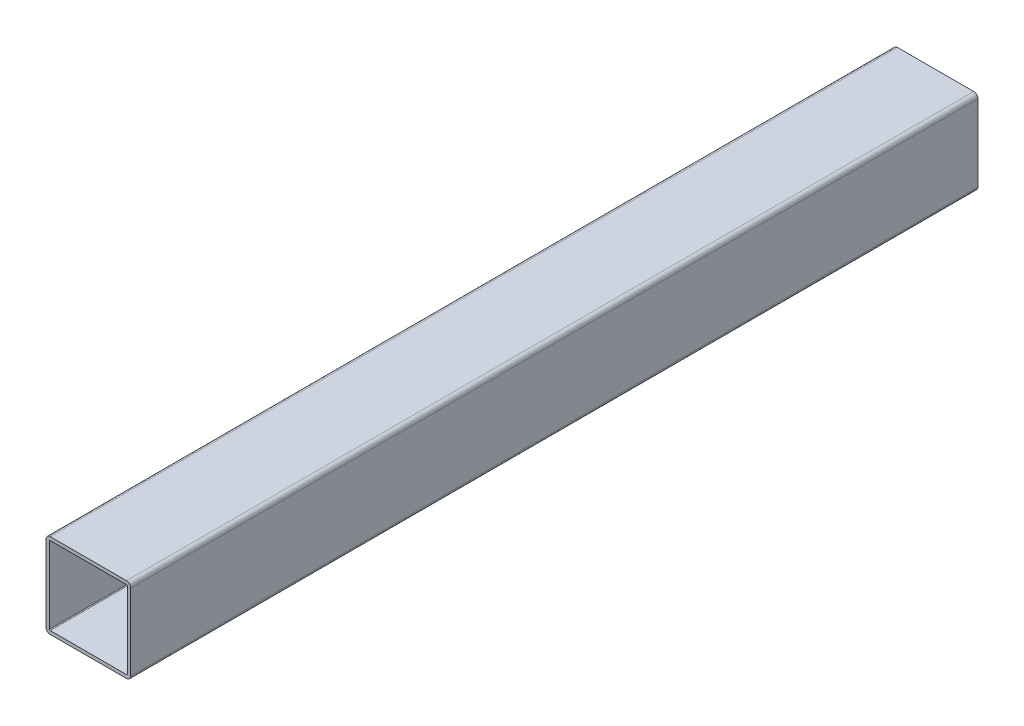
ISO-10303-21;
HEADER;
FILE_DESCRIPTION(('STEP AP214'),'2;1');
FILE_NAME('part.step','',(''),(''),'','','');
FILE_SCHEMA(('AUTOMOTIVE_DESIGN { 1 0 10303 214 1 1 1 1 }'));
ENDSEC;
DATA;
#1=APPLICATION_CONTEXT('core data for automotive mechanical design processes');
#2=APPLICATION_PROTOCOL_DEFINITION('international standard','automotive_design',2000,#1);
#3=PRODUCT_CONTEXT('',#1,'mechanical');
#4=PRODUCT('Part','Part','',(#3));
#5=PRODUCT_RELATED_PRODUCT_CATEGORY('part','',(#4));
#6=PRODUCT_DEFINITION_FORMATION('','',#4);
#7=PRODUCT_DEFINITION_CONTEXT('part definition',#1,'design');
#8=PRODUCT_DEFINITION('design','',#6,#7);
#9=PRODUCT_DEFINITION_SHAPE('','',#8);
#10=(LENGTH_UNIT() NAMED_UNIT(*) SI_UNIT(.MILLI.,.METRE.));
#11=(NAMED_UNIT(*) PLANE_ANGLE_UNIT() SI_UNIT($,.RADIAN.));
#12=(NAMED_UNIT(*) SI_UNIT($,.STERADIAN.) SOLID_ANGLE_UNIT());
#13=UNCERTAINTY_MEASURE_WITH_UNIT(LENGTH_MEASURE(1.E-05),#10,'distance_accuracy_value','');
#14=(GEOMETRIC_REPRESENTATION_CONTEXT(3) GLOBAL_UNCERTAINTY_ASSIGNED_CONTEXT((#13)) GLOBAL_UNIT_ASSIGNED_CONTEXT((#10,
#11,#12)) REPRESENTATION_CONTEXT('',''));
#15=CARTESIAN_POINT('',(0.,0.,0.));
#16=DIRECTION('',(0.,0.,1.));
#17=DIRECTION('',(1.,0.,0.));
#18=AXIS2_PLACEMENT_3D('',#15,#16,#17);
#19=CARTESIAN_POINT('',(95.,-5.,1000.));
#20=DIRECTION('',(0.,0.,1.));
#21=DIRECTION('',(1.,0.,0.));
#22=AXIS2_PLACEMENT_3D('',#19,#20,#21);
#23=PLANE('',#22);
#24=CARTESIAN_POINT('',(95.,-5.,1000.));
#25=DIRECTION('',(0.,0.,1.));
#26=DIRECTION('',(1.,0.,0.));
#27=AXIS2_PLACEMENT_3D('',#24,#25,#26);
#28=CIRCLE('',#27,5.);
#29=CARTESIAN_POINT('',(100.,-5.00000000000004,1000.));
#30=VERTEX_POINT('',#29);
#31=CARTESIAN_POINT('',(95.,0.,1000.));
#32=VERTEX_POINT('',#31);
#33=EDGE_CURVE('E229',#30,#32,#28,.T.);
#34=ORIENTED_EDGE('',*,*,#33,.T.);
#35=DIRECTION('',(-1.,0.,0.));
#36=VECTOR('',#35,1.);
#37=CARTESIAN_POINT('',(5.00000000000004,0.,1000.));
#38=LINE('',#37,#36);
#39=CARTESIAN_POINT('',(5.00000000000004,0.,1000.));
#40=VERTEX_POINT('',#39);
#41=EDGE_CURVE('E232',#32,#40,#38,.T.);
#42=ORIENTED_EDGE('',*,*,#41,.T.);
#43=CARTESIAN_POINT('',(5.,-5.,1000.));
#44=DIRECTION('',(0.,0.,1.));
#45=DIRECTION('',(1.,0.,0.));
#46=AXIS2_PLACEMENT_3D('',#43,#44,#45);
#47=CIRCLE('',#46,5.);
#48=CARTESIAN_POINT('',(0.,-5.00000000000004,1000.));
#49=VERTEX_POINT('',#48);
#50=EDGE_CURVE('E234',#40,#49,#47,.T.);
#51=ORIENTED_EDGE('',*,*,#50,.T.);
#52=DIRECTION('',(0.,-1.,0.));
#53=VECTOR('',#52,1.);
#54=CARTESIAN_POINT('',(0.,-5.00000000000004,1000.));
#55=LINE('',#54,#53);
#56=CARTESIAN_POINT('',(0.,-95.,1000.));
#57=VERTEX_POINT('',#56);
#58=EDGE_CURVE('E236',#49,#57,#55,.T.);
#59=ORIENTED_EDGE('',*,*,#58,.T.);
#60=CARTESIAN_POINT('',(5.00000000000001,-95.,1000.));
#61=DIRECTION('',(0.,0.,1.));
#62=DIRECTION('',(1.,0.,0.));
#63=AXIS2_PLACEMENT_3D('',#60,#61,#62);
#64=CIRCLE('',#63,5.);
#65=CARTESIAN_POINT('',(5.00000000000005,-100.,1000.));
#66=VERTEX_POINT('',#65);
#67=EDGE_CURVE('E238',#57,#66,#64,.T.);
#68=ORIENTED_EDGE('',*,*,#67,.T.);
#69=DIRECTION('',(1.,0.,0.));
#70=VECTOR('',#69,1.);
#71=CARTESIAN_POINT('',(5.00000000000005,-100.,1000.));
#72=LINE('',#71,#70);
#73=CARTESIAN_POINT('',(95.,-100.,1000.));
#74=VERTEX_POINT('',#73);
#75=EDGE_CURVE('E240',#66,#74,#72,.T.);
#76=ORIENTED_EDGE('',*,*,#75,.T.);
#77=CARTESIAN_POINT('',(95.,-95.,1000.));
#78=DIRECTION('',(0.,0.,1.));
#79=DIRECTION('',(-1.,0.,0.));
#80=AXIS2_PLACEMENT_3D('',#77,#78,#79);
#81=CIRCLE('',#80,5.);
#82=CARTESIAN_POINT('',(100.,-95.,1000.));
#83=VERTEX_POINT('',#82);
#84=EDGE_CURVE('E242',#74,#83,#81,.T.);
#85=ORIENTED_EDGE('',*,*,#84,.T.);
#86=DIRECTION('',(0.,1.,0.));
#87=VECTOR('',#86,1.);
#88=CARTESIAN_POINT('',(100.,-5.00000000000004,1000.));
#89=LINE('',#88,#87);
#90=EDGE_CURVE('E244',#83,#30,#89,.T.);
#91=ORIENTED_EDGE('',*,*,#90,.T.);
#92=EDGE_LOOP('',(#34,#42,#51,#59,#68,#76,#85,#91));
#93=FACE_BOUND('',#92,.T.);
#94=DIRECTION('',(0.,-1.,0.));
#95=VECTOR('',#94,1.);
#96=CARTESIAN_POINT('',(4.,-5.00000000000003,1000.));
#97=LINE('',#96,#95);
#98=CARTESIAN_POINT('',(4.,-5.00000000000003,1000.));
#99=VERTEX_POINT('',#98);
#100=CARTESIAN_POINT('',(4.00000000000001,-95.,1000.));
#101=VERTEX_POINT('',#100);
#102=EDGE_CURVE('E186',#99,#101,#97,.T.);
#103=ORIENTED_EDGE('',*,*,#102,.F.);
#104=CARTESIAN_POINT('',(5.,-5.,1000.));
#105=DIRECTION('',(0.,0.,1.));
#106=DIRECTION('',(1.,0.,0.));
#107=AXIS2_PLACEMENT_3D('',#104,#105,#106);
#108=CIRCLE('',#107,0.999999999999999);
#109=CARTESIAN_POINT('',(5.00000000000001,-4.,1000.));
#110=VERTEX_POINT('',#109);
#111=EDGE_CURVE('E162',#110,#99,#108,.T.);
#112=ORIENTED_EDGE('',*,*,#111,.F.);
#113=DIRECTION('',(-1.,0.,0.));
#114=VECTOR('',#113,1.);
#115=CARTESIAN_POINT('',(5.00000000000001,-4.,1000.));
#116=LINE('',#115,#114);
#117=CARTESIAN_POINT('',(95.,-4.,1000.));
#118=VERTEX_POINT('',#117);
#119=EDGE_CURVE('E198',#118,#110,#116,.T.);
#120=ORIENTED_EDGE('',*,*,#119,.F.);
#121=CARTESIAN_POINT('',(95.,-5.,1000.));
#122=DIRECTION('',(0.,0.,1.));
#123=DIRECTION('',(1.,0.,0.));
#124=AXIS2_PLACEMENT_3D('',#121,#122,#123);
#125=CIRCLE('',#124,1.);
#126=CARTESIAN_POINT('',(96.,-5.00000000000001,1000.));
#127=VERTEX_POINT('',#126);
#128=EDGE_CURVE('E196',#127,#118,#125,.T.);
#129=ORIENTED_EDGE('',*,*,#128,.F.);
#130=DIRECTION('',(0.,1.,0.));
#131=VECTOR('',#130,1.);
#132=CARTESIAN_POINT('',(96.,-5.00000000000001,1000.));
#133=LINE('',#132,#131);
#134=CARTESIAN_POINT('',(96.,-95.,1000.));
#135=VERTEX_POINT('',#134);
#136=EDGE_CURVE('E194',#135,#127,#133,.T.);
#137=ORIENTED_EDGE('',*,*,#136,.F.);
#138=CARTESIAN_POINT('',(95.,-95.,1000.));
#139=DIRECTION('',(0.,0.,1.));
#140=DIRECTION('',(-1.,0.,0.));
#141=AXIS2_PLACEMENT_3D('',#138,#139,#140);
#142=CIRCLE('',#141,1.);
#143=CARTESIAN_POINT('',(95.,-96.,1000.));
#144=VERTEX_POINT('',#143);
#145=EDGE_CURVE('E192',#144,#135,#142,.T.);
#146=ORIENTED_EDGE('',*,*,#145,.F.);
#147=DIRECTION('',(1.,0.,0.));
#148=VECTOR('',#147,1.);
#149=CARTESIAN_POINT('',(5.00000000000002,-96.,1000.));
#150=LINE('',#149,#148);
#151=CARTESIAN_POINT('',(5.00000000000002,-96.,1000.));
#152=VERTEX_POINT('',#151);
#153=EDGE_CURVE('E190',#152,#144,#150,.T.);
#154=ORIENTED_EDGE('',*,*,#153,.F.);
#155=CARTESIAN_POINT('',(5.00000000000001,-95.,1000.));
#156=DIRECTION('',(0.,0.,1.));
#157=DIRECTION('',(1.,0.,0.));
#158=AXIS2_PLACEMENT_3D('',#155,#156,#157);
#159=CIRCLE('',#158,1.);
#160=EDGE_CURVE('E188',#101,#152,#159,.T.);
#161=ORIENTED_EDGE('',*,*,#160,.F.);
#162=EDGE_LOOP('',(#103,#112,#120,#129,#137,#146,#154,#161));
#163=FACE_BOUND('',#162,.T.);
#164=ADVANCED_FACE('F33',(#93,#163),#23,.T.);
#165=CARTESIAN_POINT('',(95.,-5.,0.));
#166=DIRECTION('',(0.,0.,1.));
#167=DIRECTION('',(1.,0.,0.));
#168=AXIS2_PLACEMENT_3D('',#165,#166,#167);
#169=PLANE('',#168);
#170=CARTESIAN_POINT('',(95.,-5.,0.));
#171=DIRECTION('',(0.,0.,1.));
#172=DIRECTION('',(1.,0.,0.));
#173=AXIS2_PLACEMENT_3D('',#170,#171,#172);
#174=CIRCLE('',#173,5.);
#175=CARTESIAN_POINT('',(100.,-5.00000000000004,0.));
#176=VERTEX_POINT('',#175);
#177=CARTESIAN_POINT('',(95.,0.,0.));
#178=VERTEX_POINT('',#177);
#179=EDGE_CURVE('E164',#176,#178,#174,.T.);
#180=ORIENTED_EDGE('',*,*,#179,.F.);
#181=DIRECTION('',(0.,1.,0.));
#182=VECTOR('',#181,1.);
#183=CARTESIAN_POINT('',(100.,-5.00000000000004,0.));
#184=LINE('',#183,#182);
#185=CARTESIAN_POINT('',(100.,-95.,0.));
#186=VERTEX_POINT('',#185);
#187=EDGE_CURVE('E227',#186,#176,#184,.T.);
#188=ORIENTED_EDGE('',*,*,#187,.F.);
#189=CARTESIAN_POINT('',(95.,-95.,0.));
#190=DIRECTION('',(0.,0.,1.));
#191=DIRECTION('',(-1.,0.,0.));
#192=AXIS2_PLACEMENT_3D('',#189,#190,#191);
#193=CIRCLE('',#192,5.);
#194=CARTESIAN_POINT('',(95.,-100.,0.));
#195=VERTEX_POINT('',#194);
#196=EDGE_CURVE('E225',#195,#186,#193,.T.);
#197=ORIENTED_EDGE('',*,*,#196,.F.);
#198=DIRECTION('',(1.,0.,0.));
#199=VECTOR('',#198,1.);
#200=CARTESIAN_POINT('',(5.00000000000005,-100.,0.));
#201=LINE('',#200,#199);
#202=CARTESIAN_POINT('',(5.00000000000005,-100.,0.));
#203=VERTEX_POINT('',#202);
#204=EDGE_CURVE('E223',#203,#195,#201,.T.);
#205=ORIENTED_EDGE('',*,*,#204,.F.);
#206=CARTESIAN_POINT('',(5.00000000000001,-95.,0.));
#207=DIRECTION('',(0.,0.,1.));
#208=DIRECTION('',(1.,0.,0.));
#209=AXIS2_PLACEMENT_3D('',#206,#207,#208);
#210=CIRCLE('',#209,5.);
#211=CARTESIAN_POINT('',(0.,-95.,0.));
#212=VERTEX_POINT('',#211);
#213=EDGE_CURVE('E221',#212,#203,#210,.T.);
#214=ORIENTED_EDGE('',*,*,#213,.F.);
#215=DIRECTION('',(0.,-1.,0.));
#216=VECTOR('',#215,1.);
#217=CARTESIAN_POINT('',(0.,-5.00000000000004,0.));
#218=LINE('',#217,#216);
#219=CARTESIAN_POINT('',(0.,-5.00000000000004,0.));
#220=VERTEX_POINT('',#219);
#221=EDGE_CURVE('E219',#220,#212,#218,.T.);
#222=ORIENTED_EDGE('',*,*,#221,.F.);
#223=CARTESIAN_POINT('',(5.,-5.,0.));
#224=DIRECTION('',(0.,0.,1.));
#225=DIRECTION('',(1.,0.,0.));
#226=AXIS2_PLACEMENT_3D('',#223,#224,#225);
#227=CIRCLE('',#226,5.);
#228=CARTESIAN_POINT('',(5.00000000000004,0.,0.));
#229=VERTEX_POINT('',#228);
#230=EDGE_CURVE('E217',#229,#220,#227,.T.);
#231=ORIENTED_EDGE('',*,*,#230,.F.);
#232=DIRECTION('',(-1.,0.,0.));
#233=VECTOR('',#232,1.);
#234=CARTESIAN_POINT('',(5.00000000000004,0.,0.));
#235=LINE('',#234,#233);
#236=EDGE_CURVE('E215',#178,#229,#235,.T.);
#237=ORIENTED_EDGE('',*,*,#236,.F.);
#238=EDGE_LOOP('',(#180,#188,#197,#205,#214,#222,#231,#237));
#239=FACE_BOUND('',#238,.T.);
#240=CARTESIAN_POINT('',(5.,-5.,0.));
#241=DIRECTION('',(0.,0.,1.));
#242=DIRECTION('',(1.,0.,0.));
#243=AXIS2_PLACEMENT_3D('',#240,#241,#242);
#244=CIRCLE('',#243,0.999999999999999);
#245=CARTESIAN_POINT('',(5.,-4.,0.));
#246=VERTEX_POINT('',#245);
#247=CARTESIAN_POINT('',(4.,-5.00000000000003,0.));
#248=VERTEX_POINT('',#247);
#249=EDGE_CURVE('E57',#246,#248,#244,.T.);
#250=ORIENTED_EDGE('',*,*,#249,.T.);
#251=DIRECTION('',(0.,-1.,0.));
#252=VECTOR('',#251,1.);
#253=CARTESIAN_POINT('',(4.,-5.00000000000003,0.));
#254=LINE('',#253,#252);
#255=CARTESIAN_POINT('',(4.00000000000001,-95.,0.));
#256=VERTEX_POINT('',#255);
#257=EDGE_CURVE('E149',#248,#256,#254,.T.);
#258=ORIENTED_EDGE('',*,*,#257,.T.);
#259=CARTESIAN_POINT('',(5.00000000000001,-95.,0.));
#260=DIRECTION('',(0.,0.,1.));
#261=DIRECTION('',(1.,0.,0.));
#262=AXIS2_PLACEMENT_3D('',#259,#260,#261);
#263=CIRCLE('',#262,1.);
#264=CARTESIAN_POINT('',(5.00000000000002,-96.,0.));
#265=VERTEX_POINT('',#264);
#266=EDGE_CURVE('E158',#256,#265,#263,.T.);
#267=ORIENTED_EDGE('',*,*,#266,.T.);
#268=DIRECTION('',(1.,0.,0.));
#269=VECTOR('',#268,1.);
#270=CARTESIAN_POINT('',(5.00000000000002,-96.,0.));
#271=LINE('',#270,#269);
#272=CARTESIAN_POINT('',(95.,-96.,0.));
#273=VERTEX_POINT('',#272);
#274=EDGE_CURVE('E173',#265,#273,#271,.T.);
#275=ORIENTED_EDGE('',*,*,#274,.T.);
#276=CARTESIAN_POINT('',(95.,-95.,0.));
#277=DIRECTION('',(0.,0.,1.));
#278=DIRECTION('',(-1.,0.,0.));
#279=AXIS2_PLACEMENT_3D('',#276,#277,#278);
#280=CIRCLE('',#279,1.);
#281=CARTESIAN_POINT('',(96.,-95.,0.));
#282=VERTEX_POINT('',#281);
#283=EDGE_CURVE('E176',#273,#282,#280,.T.);
#284=ORIENTED_EDGE('',*,*,#283,.T.);
#285=DIRECTION('',(0.,1.,0.));
#286=VECTOR('',#285,1.);
#287=CARTESIAN_POINT('',(96.,-5.00000000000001,0.));
#288=LINE('',#287,#286);
#289=CARTESIAN_POINT('',(96.,-5.00000000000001,0.));
#290=VERTEX_POINT('',#289);
#291=EDGE_CURVE('E179',#282,#290,#288,.T.);
#292=ORIENTED_EDGE('',*,*,#291,.T.);
#293=CARTESIAN_POINT('',(95.,-5.,0.));
#294=DIRECTION('',(0.,0.,1.));
#295=DIRECTION('',(1.,0.,0.));
#296=AXIS2_PLACEMENT_3D('',#293,#294,#295);
#297=CIRCLE('',#296,1.);
#298=CARTESIAN_POINT('',(95.,-4.,0.));
#299=VERTEX_POINT('',#298);
#300=EDGE_CURVE('E182',#290,#299,#297,.T.);
#301=ORIENTED_EDGE('',*,*,#300,.T.);
#302=DIRECTION('',(-1.,0.,0.));
#303=VECTOR('',#302,1.);
#304=CARTESIAN_POINT('',(5.00000000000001,-4.,0.));
#305=LINE('',#304,#303);
#306=EDGE_CURVE('E169',#299,#246,#305,.T.);
#307=ORIENTED_EDGE('',*,*,#306,.T.);
#308=EDGE_LOOP('',(#250,#258,#267,#275,#284,#292,#301,#307));
#309=FACE_BOUND('',#308,.T.);
#310=ADVANCED_FACE('F167',(#239,#309),#169,.F.);
#311=CARTESIAN_POINT('',(95.,-5.,1000.));
#312=DIRECTION('',(0.,0.,-1.));
#313=DIRECTION('',(-1.,0.,0.));
#314=AXIS2_PLACEMENT_3D('',#311,#312,#313);
#315=CYLINDRICAL_SURFACE('',#314,5.);
#316=ORIENTED_EDGE('',*,*,#179,.T.);
#317=DIRECTION('',(0.,0.,-1.));
#318=VECTOR('',#317,1.);
#319=CARTESIAN_POINT('',(95.,0.,1000.));
#320=LINE('',#319,#318);
#321=EDGE_CURVE('E11',#32,#178,#320,.T.);
#322=ORIENTED_EDGE('',*,*,#321,.F.);
#323=ORIENTED_EDGE('',*,*,#33,.F.);
#324=DIRECTION('',(0.,0.,-1.));
#325=VECTOR('',#324,1.);
#326=CARTESIAN_POINT('',(100.,-5.00000000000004,1000.));
#327=LINE('',#326,#325);
#328=EDGE_CURVE('E246',#30,#176,#327,.T.);
#329=ORIENTED_EDGE('',*,*,#328,.T.);
#330=EDGE_LOOP('',(#316,#322,#323,#329));
#331=FACE_BOUND('',#330,.T.);
#332=ADVANCED_FACE('F35',(#331),#315,.T.);
#333=CARTESIAN_POINT('',(5.00000000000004,0.,1000.));
#334=DIRECTION('',(0.,-1.,0.));
#335=DIRECTION('',(0.,0.,-1.));
#336=AXIS2_PLACEMENT_3D('',#333,#334,#335);
#337=PLANE('',#336);
#338=ORIENTED_EDGE('',*,*,#236,.T.);
#339=DIRECTION('',(0.,0.,-1.));
#340=VECTOR('',#339,1.);
#341=CARTESIAN_POINT('',(5.00000000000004,0.,1000.));
#342=LINE('',#341,#340);
#343=EDGE_CURVE('E42',#40,#229,#342,.T.);
#344=ORIENTED_EDGE('',*,*,#343,.F.);
#345=ORIENTED_EDGE('',*,*,#41,.F.);
#346=ORIENTED_EDGE('',*,*,#321,.T.);
#347=EDGE_LOOP('',(#338,#344,#345,#346));
#348=FACE_BOUND('',#347,.T.);
#349=ADVANCED_FACE('F292',(#348),#337,.F.);
#350=CARTESIAN_POINT('',(5.,-5.,1000.));
#351=DIRECTION('',(0.,0.,-1.));
#352=DIRECTION('',(-1.,0.,0.));
#353=AXIS2_PLACEMENT_3D('',#350,#351,#352);
#354=CYLINDRICAL_SURFACE('',#353,5.);
#355=ORIENTED_EDGE('',*,*,#230,.T.);
#356=DIRECTION('',(0.,0.,-1.));
#357=VECTOR('',#356,1.);
#358=CARTESIAN_POINT('',(0.,-5.00000000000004,1000.));
#359=LINE('',#358,#357);
#360=EDGE_CURVE('E263',#49,#220,#359,.T.);
#361=ORIENTED_EDGE('',*,*,#360,.F.);
#362=ORIENTED_EDGE('',*,*,#50,.F.);
#363=ORIENTED_EDGE('',*,*,#343,.T.);
#364=EDGE_LOOP('',(#355,#361,#362,#363));
#365=FACE_BOUND('',#364,.T.);
#366=ADVANCED_FACE('F270',(#365),#354,.T.);
#367=CARTESIAN_POINT('',(0.,-5.00000000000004,1000.));
#368=DIRECTION('',(1.,0.,0.));
#369=DIRECTION('',(0.,1.,0.));
#370=AXIS2_PLACEMENT_3D('',#367,#368,#369);
#371=PLANE('',#370);
#372=ORIENTED_EDGE('',*,*,#221,.T.);
#373=DIRECTION('',(0.,0.,-1.));
#374=VECTOR('',#373,1.);
#375=CARTESIAN_POINT('',(0.,-95.,1000.));
#376=LINE('',#375,#374);
#377=EDGE_CURVE('E260',#57,#212,#376,.T.);
#378=ORIENTED_EDGE('',*,*,#377,.F.);
#379=ORIENTED_EDGE('',*,*,#58,.F.);
#380=ORIENTED_EDGE('',*,*,#360,.T.);
#381=EDGE_LOOP('',(#372,#378,#379,#380));
#382=FACE_BOUND('',#381,.T.);
#383=ADVANCED_FACE('F280',(#382),#371,.F.);
#384=CARTESIAN_POINT('',(5.00000000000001,-95.,1000.));
#385=DIRECTION('',(0.,0.,-1.));
#386=DIRECTION('',(-1.,0.,0.));
#387=AXIS2_PLACEMENT_3D('',#384,#385,#386);
#388=CYLINDRICAL_SURFACE('',#387,5.);
#389=ORIENTED_EDGE('',*,*,#213,.T.);
#390=DIRECTION('',(0.,0.,-1.));
#391=VECTOR('',#390,1.);
#392=CARTESIAN_POINT('',(5.00000000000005,-100.,1000.));
#393=LINE('',#392,#391);
#394=EDGE_CURVE('E256',#66,#203,#393,.T.);
#395=ORIENTED_EDGE('',*,*,#394,.F.);
#396=ORIENTED_EDGE('',*,*,#67,.F.);
#397=ORIENTED_EDGE('',*,*,#377,.T.);
#398=EDGE_LOOP('',(#389,#395,#396,#397));
#399=FACE_BOUND('',#398,.T.);
#400=ADVANCED_FACE('F284',(#399),#388,.T.);
#401=CARTESIAN_POINT('',(5.00000000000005,-100.,1000.));
#402=DIRECTION('',(0.,1.,0.));
#403=DIRECTION('',(0.,0.,1.));
#404=AXIS2_PLACEMENT_3D('',#401,#402,#403);
#405=PLANE('',#404);
#406=ORIENTED_EDGE('',*,*,#204,.T.);
#407=DIRECTION('',(0.,0.,-1.));
#408=VECTOR('',#407,1.);
#409=CARTESIAN_POINT('',(95.,-100.,1000.));
#410=LINE('',#409,#408);
#411=EDGE_CURVE('E253',#74,#195,#410,.T.);
#412=ORIENTED_EDGE('',*,*,#411,.F.);
#413=ORIENTED_EDGE('',*,*,#75,.F.);
#414=ORIENTED_EDGE('',*,*,#394,.T.);
#415=EDGE_LOOP('',(#406,#412,#413,#414));
#416=FACE_BOUND('',#415,.T.);
#417=ADVANCED_FACE('F305',(#416),#405,.F.);
#418=CARTESIAN_POINT('',(95.,-95.,1000.));
#419=DIRECTION('',(0.,0.,-1.));
#420=DIRECTION('',(-1.,0.,0.));
#421=AXIS2_PLACEMENT_3D('',#418,#419,#420);
#422=CYLINDRICAL_SURFACE('',#421,5.);
#423=ORIENTED_EDGE('',*,*,#196,.T.);
#424=DIRECTION('',(0.,0.,-1.));
#425=VECTOR('',#424,1.);
#426=CARTESIAN_POINT('',(100.,-95.,1000.));
#427=LINE('',#426,#425);
#428=EDGE_CURVE('E250',#83,#186,#427,.T.);
#429=ORIENTED_EDGE('',*,*,#428,.F.);
#430=ORIENTED_EDGE('',*,*,#84,.F.);
#431=ORIENTED_EDGE('',*,*,#411,.T.);
#432=EDGE_LOOP('',(#423,#429,#430,#431));
#433=FACE_BOUND('',#432,.T.);
#434=ADVANCED_FACE('F303',(#433),#422,.T.);
#435=CARTESIAN_POINT('',(100.,-5.00000000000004,1000.));
#436=DIRECTION('',(-1.,0.,0.));
#437=DIRECTION('',(0.,0.,1.));
#438=AXIS2_PLACEMENT_3D('',#435,#436,#437);
#439=PLANE('',#438);
#440=ORIENTED_EDGE('',*,*,#187,.T.);
#441=ORIENTED_EDGE('',*,*,#328,.F.);
#442=ORIENTED_EDGE('',*,*,#90,.F.);
#443=ORIENTED_EDGE('',*,*,#428,.T.);
#444=EDGE_LOOP('',(#440,#441,#442,#443));
#445=FACE_BOUND('',#444,.T.);
#446=ADVANCED_FACE('F298',(#445),#439,.F.);
#447=CARTESIAN_POINT('',(5.,-5.,1000.));
#448=DIRECTION('',(0.,0.,-1.));
#449=DIRECTION('',(-1.,0.,0.));
#450=AXIS2_PLACEMENT_3D('',#447,#448,#449);
#451=CYLINDRICAL_SURFACE('',#450,0.999999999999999);
#452=ORIENTED_EDGE('',*,*,#249,.F.);
#453=DIRECTION('',(0.,0.,-1.));
#454=VECTOR('',#453,1.);
#455=CARTESIAN_POINT('',(5.00000000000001,-4.,1000.));
#456=LINE('',#455,#454);
#457=EDGE_CURVE('E200',#110,#246,#456,.T.);
#458=ORIENTED_EDGE('',*,*,#457,.F.);
#459=ORIENTED_EDGE('',*,*,#111,.T.);
#460=DIRECTION('',(0.,0.,-1.));
#461=VECTOR('',#460,1.);
#462=CARTESIAN_POINT('',(4.,-5.00000000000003,1000.));
#463=LINE('',#462,#461);
#464=EDGE_CURVE('E151',#99,#248,#463,.T.);
#465=ORIENTED_EDGE('',*,*,#464,.T.);
#466=EDGE_LOOP('',(#452,#458,#459,#465));
#467=FACE_BOUND('',#466,.T.);
#468=ADVANCED_FACE('F160',(#467),#451,.F.);
#469=CARTESIAN_POINT('',(4.,-5.00000000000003,1000.));
#470=DIRECTION('',(1.,0.,0.));
#471=DIRECTION('',(0.,1.,0.));
#472=AXIS2_PLACEMENT_3D('',#469,#470,#471);
#473=PLANE('',#472);
#474=ORIENTED_EDGE('',*,*,#257,.F.);
#475=ORIENTED_EDGE('',*,*,#464,.F.);
#476=ORIENTED_EDGE('',*,*,#102,.T.);
#477=DIRECTION('',(0.,0.,-1.));
#478=VECTOR('',#477,1.);
#479=CARTESIAN_POINT('',(4.00000000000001,-95.,1000.));
#480=LINE('',#479,#478);
#481=EDGE_CURVE('E154',#101,#256,#480,.T.);
#482=ORIENTED_EDGE('',*,*,#481,.T.);
#483=EDGE_LOOP('',(#474,#475,#476,#482));
#484=FACE_BOUND('',#483,.T.);
#485=ADVANCED_FACE('F150',(#484),#473,.T.);
#486=CARTESIAN_POINT('',(5.00000000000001,-95.,1000.));
#487=DIRECTION('',(0.,0.,-1.));
#488=DIRECTION('',(-1.,0.,0.));
#489=AXIS2_PLACEMENT_3D('',#486,#487,#488);
#490=CYLINDRICAL_SURFACE('',#489,1.);
#491=ORIENTED_EDGE('',*,*,#266,.F.);
#492=ORIENTED_EDGE('',*,*,#481,.F.);
#493=ORIENTED_EDGE('',*,*,#160,.T.);
#494=DIRECTION('',(0.,0.,-1.));
#495=VECTOR('',#494,1.);
#496=CARTESIAN_POINT('',(5.00000000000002,-96.,1000.));
#497=LINE('',#496,#495);
#498=EDGE_CURVE('E209',#152,#265,#497,.T.);
#499=ORIENTED_EDGE('',*,*,#498,.T.);
#500=EDGE_LOOP('',(#491,#492,#493,#499));
#501=FACE_BOUND('',#500,.T.);
#502=ADVANCED_FACE('F329',(#501),#490,.F.);
#503=CARTESIAN_POINT('',(5.00000000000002,-96.,1000.));
#504=DIRECTION('',(0.,1.,0.));
#505=DIRECTION('',(0.,0.,1.));
#506=AXIS2_PLACEMENT_3D('',#503,#504,#505);
#507=PLANE('',#506);
#508=ORIENTED_EDGE('',*,*,#274,.F.);
#509=ORIENTED_EDGE('',*,*,#498,.F.);
#510=ORIENTED_EDGE('',*,*,#153,.T.);
#511=DIRECTION('',(0.,0.,-1.));
#512=VECTOR('',#511,1.);
#513=CARTESIAN_POINT('',(95.,-96.,1000.));
#514=LINE('',#513,#512);
#515=EDGE_CURVE('E207',#144,#273,#514,.T.);
#516=ORIENTED_EDGE('',*,*,#515,.T.);
#517=EDGE_LOOP('',(#508,#509,#510,#516));
#518=FACE_BOUND('',#517,.T.);
#519=ADVANCED_FACE('F334',(#518),#507,.T.);
#520=CARTESIAN_POINT('',(95.,-95.,1000.));
#521=DIRECTION('',(0.,0.,-1.));
#522=DIRECTION('',(-1.,0.,0.));
#523=AXIS2_PLACEMENT_3D('',#520,#521,#522);
#524=CYLINDRICAL_SURFACE('',#523,1.);
#525=ORIENTED_EDGE('',*,*,#283,.F.);
#526=ORIENTED_EDGE('',*,*,#515,.F.);
#527=ORIENTED_EDGE('',*,*,#145,.T.);
#528=DIRECTION('',(0.,0.,-1.));
#529=VECTOR('',#528,1.);
#530=CARTESIAN_POINT('',(96.,-95.,1000.));
#531=LINE('',#530,#529);
#532=EDGE_CURVE('E205',#135,#282,#531,.T.);
#533=ORIENTED_EDGE('',*,*,#532,.T.);
#534=EDGE_LOOP('',(#525,#526,#527,#533));
#535=FACE_BOUND('',#534,.T.);
#536=ADVANCED_FACE('F338',(#535),#524,.F.);
#537=CARTESIAN_POINT('',(96.,-5.00000000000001,1000.));
#538=DIRECTION('',(-1.,0.,0.));
#539=DIRECTION('',(0.,0.,1.));
#540=AXIS2_PLACEMENT_3D('',#537,#538,#539);
#541=PLANE('',#540);
#542=ORIENTED_EDGE('',*,*,#291,.F.);
#543=ORIENTED_EDGE('',*,*,#532,.F.);
#544=ORIENTED_EDGE('',*,*,#136,.T.);
#545=DIRECTION('',(0.,0.,-1.));
#546=VECTOR('',#545,1.);
#547=CARTESIAN_POINT('',(96.,-5.00000000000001,1000.));
#548=LINE('',#547,#546);
#549=EDGE_CURVE('E203',#127,#290,#548,.T.);
#550=ORIENTED_EDGE('',*,*,#549,.T.);
#551=EDGE_LOOP('',(#542,#543,#544,#550));
#552=FACE_BOUND('',#551,.T.);
#553=ADVANCED_FACE('F342',(#552),#541,.T.);
#554=CARTESIAN_POINT('',(95.,-5.,1000.));
#555=DIRECTION('',(0.,0.,-1.));
#556=DIRECTION('',(-1.,0.,0.));
#557=AXIS2_PLACEMENT_3D('',#554,#555,#556);
#558=CYLINDRICAL_SURFACE('',#557,1.);
#559=ORIENTED_EDGE('',*,*,#300,.F.);
#560=ORIENTED_EDGE('',*,*,#549,.F.);
#561=ORIENTED_EDGE('',*,*,#128,.T.);
#562=DIRECTION('',(0.,0.,-1.));
#563=VECTOR('',#562,1.);
#564=CARTESIAN_POINT('',(95.,-4.,1000.));
#565=LINE('',#564,#563);
#566=EDGE_CURVE('E49',#118,#299,#565,.T.);
#567=ORIENTED_EDGE('',*,*,#566,.T.);
#568=EDGE_LOOP('',(#559,#560,#561,#567));
#569=FACE_BOUND('',#568,.T.);
#570=ADVANCED_FACE('F346',(#569),#558,.F.);
#571=CARTESIAN_POINT('',(5.00000000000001,-4.,1000.));
#572=DIRECTION('',(0.,-1.,0.));
#573=DIRECTION('',(0.,0.,-1.));
#574=AXIS2_PLACEMENT_3D('',#571,#572,#573);
#575=PLANE('',#574);
#576=ORIENTED_EDGE('',*,*,#306,.F.);
#577=ORIENTED_EDGE('',*,*,#566,.F.);
#578=ORIENTED_EDGE('',*,*,#119,.T.);
#579=ORIENTED_EDGE('',*,*,#457,.T.);
#580=EDGE_LOOP('',(#576,#577,#578,#579));
#581=FACE_BOUND('',#580,.T.);
#582=ADVANCED_FACE('F350',(#581),#575,.T.);
#583=CLOSED_SHELL('',(#164,#310,#332,#349,#366,#383,#400,#417,#434,#446,#468,#485,#502,#519,
#536,#553,#570,#582));
#584=MANIFOLD_SOLID_BREP('B2',#583);
#585=ADVANCED_BREP_SHAPE_REPRESENTATION('',(#18,#584),#14);
#586=SHAPE_DEFINITION_REPRESENTATION(#9,#585);
ENDSEC;
END-ISO-10303-21;
